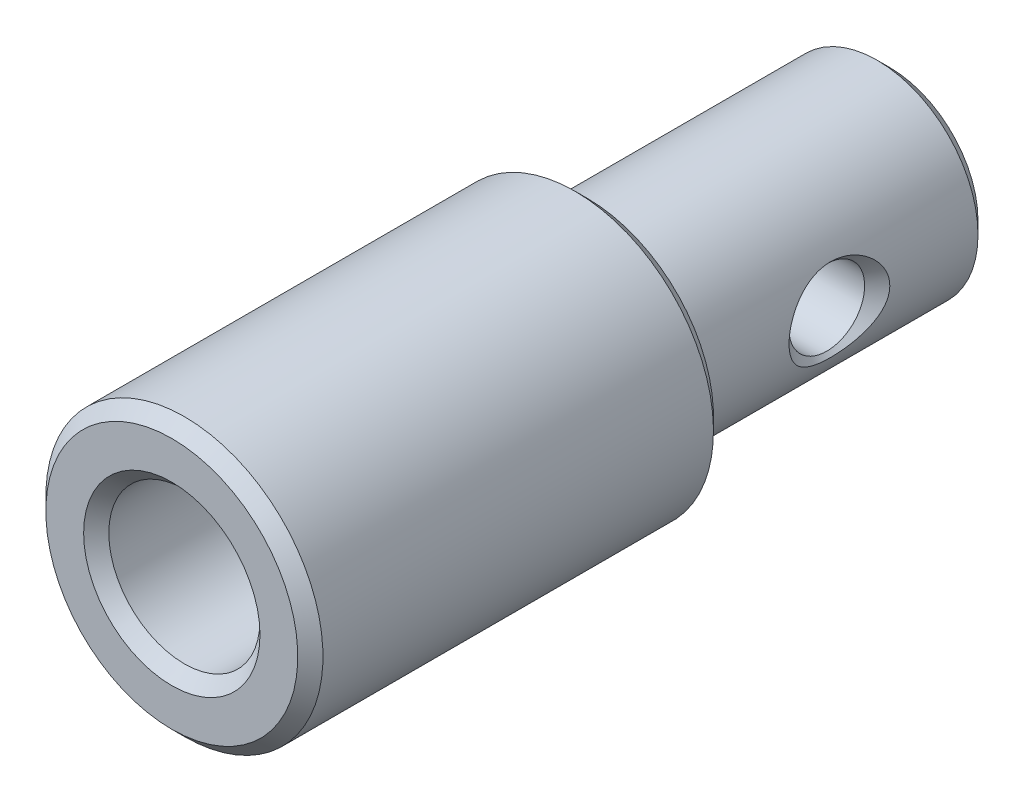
ISO-10303-21;
HEADER;
FILE_DESCRIPTION(('STEP AP214'),'2;1');
FILE_NAME('part.step','',(''),(''),'','','');
FILE_SCHEMA(('AUTOMOTIVE_DESIGN { 1 0 10303 214 1 1 1 1 }'));
ENDSEC;
DATA;
#1=APPLICATION_CONTEXT('core data for automotive mechanical design processes');
#2=APPLICATION_PROTOCOL_DEFINITION('international standard','automotive_design',2000,#1);
#3=PRODUCT_CONTEXT('',#1,'mechanical');
#4=PRODUCT('Part','Part','',(#3));
#5=PRODUCT_RELATED_PRODUCT_CATEGORY('part','',(#4));
#6=PRODUCT_DEFINITION_FORMATION('','',#4);
#7=PRODUCT_DEFINITION_CONTEXT('part definition',#1,'design');
#8=PRODUCT_DEFINITION('design','',#6,#7);
#9=PRODUCT_DEFINITION_SHAPE('','',#8);
#10=(LENGTH_UNIT() NAMED_UNIT(*) SI_UNIT(.MILLI.,.METRE.));
#11=(NAMED_UNIT(*) PLANE_ANGLE_UNIT() SI_UNIT($,.RADIAN.));
#12=(NAMED_UNIT(*) SI_UNIT($,.STERADIAN.) SOLID_ANGLE_UNIT());
#13=UNCERTAINTY_MEASURE_WITH_UNIT(LENGTH_MEASURE(1.E-05),#10,'distance_accuracy_value','');
#14=(GEOMETRIC_REPRESENTATION_CONTEXT(3) GLOBAL_UNCERTAINTY_ASSIGNED_CONTEXT((#13)) GLOBAL_UNIT_ASSIGNED_CONTEXT((#10,
#11,#12)) REPRESENTATION_CONTEXT('',''));
#15=CARTESIAN_POINT('',(0.,0.,0.));
#16=DIRECTION('',(0.,0.,1.));
#17=DIRECTION('',(1.,0.,0.));
#18=AXIS2_PLACEMENT_3D('',#15,#16,#17);
#19=CARTESIAN_POINT('',(0.,0.,0.));
#20=DIRECTION('',(0.,0.,1.));
#21=DIRECTION('',(0.,1.,0.));
#22=AXIS2_PLACEMENT_3D('',#19,#20,#21);
#23=CYLINDRICAL_SURFACE('',#22,4.);
#24=CARTESIAN_POINT('',(0.,0.,-16.9));
#25=DIRECTION('',(0.,0.,1.));
#26=DIRECTION('',(0.,1.,0.));
#27=AXIS2_PLACEMENT_3D('',#24,#25,#26);
#28=CIRCLE('',#27,4.);
#29=CARTESIAN_POINT('',(0.,4.,-16.9));
#30=VERTEX_POINT('',#29);
#31=EDGE_CURVE('E8',#30,#30,#28,.F.);
#32=ORIENTED_EDGE('',*,*,#31,.T.);
#33=EDGE_LOOP('',(#32));
#34=FACE_BOUND('',#33,.T.);
#35=CARTESIAN_POINT('',(-3.80472937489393,-1.23451791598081,-21.1835602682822));
#36=CARTESIAN_POINT('',(-3.82141231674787,-1.18309693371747,-21.1124648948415));
#37=CARTESIAN_POINT('',(-3.83847771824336,-1.12697352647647,-21.044888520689));
#38=CARTESIAN_POINT('',(-3.87208360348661,-1.00545328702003,-20.9184980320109));
#39=CARTESIAN_POINT('',(-3.88862452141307,-0.940064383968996,-20.8596765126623));
#40=CARTESIAN_POINT('',(-3.9186400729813,-0.805400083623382,-20.7567373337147));
#41=CARTESIAN_POINT('',(-3.93224905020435,-0.736730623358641,-20.7118720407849));
#42=CARTESIAN_POINT('',(-3.9565321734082,-0.592604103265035,-20.6336117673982));
#43=CARTESIAN_POINT('',(-3.96720735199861,-0.517149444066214,-20.6002127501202));
#44=CARTESIAN_POINT('',(-3.9845065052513,-0.36048765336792,-20.5467630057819));
#45=CARTESIAN_POINT('',(-3.99109919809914,-0.279241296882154,-20.5268152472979));
#46=CARTESIAN_POINT('',(-3.99921909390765,-0.114222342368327,-20.5023124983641));
#47=CARTESIAN_POINT('',(-4.00075049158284,-0.0304518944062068,-20.4977447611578));
#48=CARTESIAN_POINT('',(-3.99868687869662,0.125873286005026,-20.5039430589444));
#49=CARTESIAN_POINT('',(-3.99571044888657,0.198517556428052,-20.512858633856));
#50=CARTESIAN_POINT('',(-3.98606302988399,0.341197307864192,-20.5421156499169));
#51=CARTESIAN_POINT('',(-3.97939153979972,0.411232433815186,-20.5624586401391));
#52=CARTESIAN_POINT('',(-3.96294986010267,0.547523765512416,-20.6135588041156));
#53=CARTESIAN_POINT('',(-3.95315821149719,0.613749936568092,-20.6443882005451));
#54=CARTESIAN_POINT('',(-3.93132701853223,0.74083216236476,-20.7149617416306));
#55=CARTESIAN_POINT('',(-3.91928665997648,0.801686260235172,-20.7547091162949));
#56=CARTESIAN_POINT('',(-3.89181143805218,0.926559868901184,-20.8485630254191));
#57=CARTESIAN_POINT('',(-3.87614069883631,0.989565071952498,-20.9039455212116));
#58=CARTESIAN_POINT('',(-3.84420174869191,1.10717346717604,-21.0228419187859));
#59=CARTESIAN_POINT('',(-3.8279331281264,1.16177076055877,-21.0863614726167));
#60=CARTESIAN_POINT('',(-3.79253331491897,1.27310482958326,-21.2341870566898));
#61=CARTESIAN_POINT('',(-3.77352863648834,1.3278298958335,-21.3200416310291));
#62=CARTESIAN_POINT('',(-3.73809254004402,1.42454132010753,-21.4991475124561));
#63=CARTESIAN_POINT('',(-3.72166287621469,1.46651901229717,-21.5924037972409));
#64=CARTESIAN_POINT('',(-3.69066832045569,1.54303013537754,-21.7992249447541));
#65=CARTESIAN_POINT('',(-3.67678583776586,1.57540517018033,-21.9136988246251));
#66=CARTESIAN_POINT('',(-3.65625234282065,1.6224927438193,-22.1468372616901));
#67=CARTESIAN_POINT('',(-3.64960133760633,1.63720526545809,-22.2655018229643));
#68=CARTESIAN_POINT('',(-3.64433037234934,1.64891110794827,-22.5076964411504));
#69=CARTESIAN_POINT('',(-3.6459732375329,1.64532450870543,-22.6312609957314));
#70=CARTESIAN_POINT('',(-3.65767185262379,1.61914610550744,-22.8759889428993));
#71=CARTESIAN_POINT('',(-3.66773070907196,1.59654728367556,-22.9971514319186));
#72=CARTESIAN_POINT('',(-3.69482241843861,1.5327995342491,-23.2332761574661));
#73=CARTESIAN_POINT('',(-3.71183466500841,1.49170538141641,-23.3482555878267));
#74=CARTESIAN_POINT('',(-3.75060699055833,1.39134240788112,-23.5691743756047));
#75=CARTESIAN_POINT('',(-3.77236629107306,1.33207656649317,-23.6751152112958));
#76=CARTESIAN_POINT('',(-3.81405910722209,1.20687829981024,-23.8579717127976));
#77=CARTESIAN_POINT('',(-3.83370627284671,1.14363586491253,-23.9367975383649));
#78=CARTESIAN_POINT('',(-3.87238608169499,1.00488471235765,-24.0829673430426));
#79=CARTESIAN_POINT('',(-3.89141956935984,0.929393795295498,-24.1503276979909));
#80=CARTESIAN_POINT('',(-3.9231895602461,0.782960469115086,-24.2584069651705));
#81=CARTESIAN_POINT('',(-3.93642671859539,0.714076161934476,-24.301760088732));
#82=CARTESIAN_POINT('',(-3.95988417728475,0.569775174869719,-24.3769576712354));
#83=CARTESIAN_POINT('',(-3.97010639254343,0.4943626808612,-24.4088094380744));
#84=CARTESIAN_POINT('',(-3.98646371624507,0.338098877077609,-24.4591945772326));
#85=CARTESIAN_POINT('',(-3.99256815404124,0.25721158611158,-24.4776280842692));
#86=CARTESIAN_POINT('',(-3.99975341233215,0.0932110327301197,-24.4992847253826));
#87=CARTESIAN_POINT('',(-4.00083768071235,0.0100993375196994,-24.5025182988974));
#88=CARTESIAN_POINT('',(-3.99802883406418,-0.145114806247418,-24.494080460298));
#89=CARTESIAN_POINT('',(-3.99472275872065,-0.217331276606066,-24.4841671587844));
#90=CARTESIAN_POINT('',(-3.98448925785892,-0.359015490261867,-24.4530847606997));
#91=CARTESIAN_POINT('',(-3.97756132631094,-0.428482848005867,-24.4319140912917));
#92=CARTESIAN_POINT('',(-3.96062415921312,-0.564095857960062,-24.3791348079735));
#93=CARTESIAN_POINT('',(-3.95057035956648,-0.63017623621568,-24.3473747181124));
#94=CARTESIAN_POINT('',(-3.92827112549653,-0.756855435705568,-24.2749939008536));
#95=CARTESIAN_POINT('',(-3.91602485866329,-0.817452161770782,-24.23436980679));
#96=CARTESIAN_POINT('',(-3.88811955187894,-0.941929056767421,-24.1384963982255));
#97=CARTESIAN_POINT('',(-3.87222905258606,-1.00475028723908,-24.0819438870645));
#98=CARTESIAN_POINT('',(-3.83994441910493,-1.12183861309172,-23.9607278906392));
#99=CARTESIAN_POINT('',(-3.82354993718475,-1.17609963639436,-23.8960587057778));
#100=CARTESIAN_POINT('',(-3.78799301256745,-1.28652907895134,-23.7457227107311));
#101=CARTESIAN_POINT('',(-3.76898272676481,-1.34065241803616,-23.65851417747));
#102=CARTESIAN_POINT('',(-3.7337166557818,-1.43594657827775,-23.4767612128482));
#103=CARTESIAN_POINT('',(-3.71746272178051,-1.47710871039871,-23.3822119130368));
#104=CARTESIAN_POINT('',(-3.68711991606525,-1.55145399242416,-23.1731722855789));
#105=CARTESIAN_POINT('',(-3.67372167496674,-1.58251369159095,-23.057818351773));
#106=CARTESIAN_POINT('',(-3.65432280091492,-1.6268108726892,-22.8231560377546));
#107=CARTESIAN_POINT('',(-3.64832162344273,-1.64004966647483,-22.7038479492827));
#108=CARTESIAN_POINT('',(-3.64446625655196,-1.64860437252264,-22.461128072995));
#109=CARTESIAN_POINT('',(-3.64684243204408,-1.6434134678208,-22.3376941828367));
#110=CARTESIAN_POINT('',(-3.65992497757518,-1.61406255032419,-22.0934818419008));
#111=CARTESIAN_POINT('',(-3.67063702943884,-1.58988959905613,-21.9727052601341));
#112=CARTESIAN_POINT('',(-3.69928162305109,-1.52207114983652,-21.7342120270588));
#113=CARTESIAN_POINT('',(-3.71739445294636,-1.47793626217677,-21.6166562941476));
#114=CARTESIAN_POINT('',(-3.75832969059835,-1.37049287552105,-21.3915832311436));
#115=CARTESIAN_POINT('',(-3.78114743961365,-1.30720331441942,-21.2840561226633));
#116=CARTESIAN_POINT('',(-3.80472937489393,-1.23451791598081,-21.1835602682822));
#117=B_SPLINE_CURVE_WITH_KNOTS('',3,(#35,#36,#37,#38,#39,#40,#41,#42,#43,#44,#45,#46,#47,#48,
#49,#50,#51,#52,#53,#54,#55,#56,#57,#58,#59,#60,#61,#62,#63,#64,#65,#66,#67,#68,#69,#70,#71,#72,
#73,#74,#75,#76,#77,#78,#79,#80,#81,#82,#83,#84,#85,#86,#87,#88,#89,#90,#91,#92,#93,#94,#95,#96,
#97,#98,#99,#100,#101,#102,#103,#104,#105,#106,#107,#108,#109,#110,#111,#112,#113,#114,#115,
#116),.UNSPECIFIED.,.T.,.F.,(4,2,2,2,2,2,2,2,2,2,2,2,2,2,2,2,2,2,2,2,2,2,2,2,2,2,2,2,2,2,2,2,2,
2,2,2,2,2,2,2,4),(0.,0.267679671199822,0.535131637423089,0.78358699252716,1.03195478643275,
1.28220286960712,1.53224349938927,1.75093901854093,1.96966419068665,2.18992735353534,
2.41027042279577,2.66536290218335,2.92063354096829,3.23016058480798,3.53989758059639,
3.89758355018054,4.25526986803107,4.62436074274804,4.99358791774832,5.36172873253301,
5.72980922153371,6.03748706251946,6.34472169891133,6.59113405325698,6.83738956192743,
7.0854595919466,7.33335922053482,7.55122876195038,7.76912875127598,7.99028990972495,
8.21153521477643,8.46862977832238,8.72590589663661,9.03785534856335,9.35001348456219,
9.70900233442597,10.0679647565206,10.436874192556,10.8060353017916,11.1847833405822,
11.5631581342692),.UNSPECIFIED.);
#118=CARTESIAN_POINT('',(-3.80472937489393,-1.23451791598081,-21.1835602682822));
#119=VERTEX_POINT('',#118);
#120=EDGE_CURVE('E53',#119,#119,#117,.T.);
#121=ORIENTED_EDGE('',*,*,#120,.F.);
#122=EDGE_LOOP('',(#121));
#123=FACE_BOUND('',#122,.T.);
#124=CARTESIAN_POINT('',(0.,0.,-28.));
#125=DIRECTION('',(0.,0.,1.));
#126=DIRECTION('',(0.,1.,0.));
#127=AXIS2_PLACEMENT_3D('',#124,#125,#126);
#128=CIRCLE('',#127,4.);
#129=CARTESIAN_POINT('',(0.,4.,-28.));
#130=VERTEX_POINT('',#129);
#131=EDGE_CURVE('E32',#130,#130,#128,.T.);
#132=ORIENTED_EDGE('',*,*,#131,.T.);
#133=EDGE_LOOP('',(#132));
#134=FACE_BOUND('',#133,.T.);
#135=CARTESIAN_POINT('',(3.80472937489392,-1.23451791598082,-21.1835602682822));
#136=CARTESIAN_POINT('',(3.78241175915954,-1.30330627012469,-21.2786677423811));
#137=CARTESIAN_POINT('',(3.76077247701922,-1.36369021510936,-21.3800959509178));
#138=CARTESIAN_POINT('',(3.72155319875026,-1.46735243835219,-21.5921492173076));
#139=CARTESIAN_POINT('',(3.70397924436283,-1.5106053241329,-21.702787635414));
#140=CARTESIAN_POINT('',(3.67498709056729,-1.57984059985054,-21.9309920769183));
#141=CARTESIAN_POINT('',(3.66361294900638,-1.60569967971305,-22.0486012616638));
#142=CARTESIAN_POINT('',(3.64871737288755,-1.63926954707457,-22.2867884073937));
#143=CARTESIAN_POINT('',(3.64519065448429,-1.64699254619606,-22.407364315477));
#144=CARTESIAN_POINT('',(3.64647116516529,-1.64415740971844,-22.6507343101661));
#145=CARTESIAN_POINT('',(3.65145045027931,-1.63322186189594,-22.773523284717));
#146=CARTESIAN_POINT('',(3.66937803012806,-1.59252926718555,-23.0154199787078));
#147=CARTESIAN_POINT('',(3.68233183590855,-1.56275920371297,-23.1345250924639));
#148=CARTESIAN_POINT('',(3.71447101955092,-1.48474920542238,-23.3657956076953));
#149=CARTESIAN_POINT('',(3.73366407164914,-1.43648651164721,-23.4779522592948));
#150=CARTESIAN_POINT('',(3.77578170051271,-1.32181445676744,-23.6918369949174));
#151=CARTESIAN_POINT('',(3.79870412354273,-1.2554155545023,-23.7935710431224));
#152=CARTESIAN_POINT('',(3.84036373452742,-1.12048758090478,-23.9629675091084));
#153=CARTESIAN_POINT('',(3.85897820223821,-1.05528278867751,-24.0333130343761));
#154=CARTESIAN_POINT('',(3.89485380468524,-0.914003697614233,-24.162491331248));
#155=CARTESIAN_POINT('',(3.91211692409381,-0.837945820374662,-24.221341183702));
#156=CARTESIAN_POINT('',(3.94046761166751,-0.690827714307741,-24.3149793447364));
#157=CARTESIAN_POINT('',(3.95210697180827,-0.621429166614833,-24.3522032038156));
#158=CARTESIAN_POINT('',(3.97210911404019,-0.477115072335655,-24.4151131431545));
#159=CARTESIAN_POINT('',(3.98047400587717,-0.402203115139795,-24.4408066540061));
#160=CARTESIAN_POINT('',(3.99304005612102,-0.248237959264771,-24.4791092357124));
#161=CARTESIAN_POINT('',(3.99721606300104,-0.169162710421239,-24.491639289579));
#162=CARTESIAN_POINT('',(4.00077878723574,-0.00994168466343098,-24.5023417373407));
#163=CARTESIAN_POINT('',(4.00016728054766,0.070203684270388,-24.5005194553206));
#164=CARTESIAN_POINT('',(3.99454071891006,0.220831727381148,-24.483580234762));
#165=CARTESIAN_POINT('',(3.98996665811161,0.291486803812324,-24.4697944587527));
#166=CARTESIAN_POINT('',(3.97747579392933,0.429526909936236,-24.4315820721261));
#167=CARTESIAN_POINT('',(3.96955834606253,0.496911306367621,-24.4071534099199));
#168=CARTESIAN_POINT('',(3.95066634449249,0.630053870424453,-24.3475931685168));
#169=CARTESIAN_POINT('',(3.93956835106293,0.695596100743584,-24.3120225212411));
#170=CARTESIAN_POINT('',(3.91541233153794,0.820741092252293,-24.2322118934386));
#171=CARTESIAN_POINT('',(3.90235343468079,0.880341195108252,-24.1879680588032));
#172=CARTESIAN_POINT('',(3.87276884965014,1.00316102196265,-24.0837492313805));
#173=CARTESIAN_POINT('',(3.85603944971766,1.06514235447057,-24.0223759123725));
#174=CARTESIAN_POINT('',(3.8224839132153,1.17991420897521,-23.8915999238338));
#175=CARTESIAN_POINT('',(3.80565771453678,1.23269793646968,-23.8221913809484));
#176=CARTESIAN_POINT('',(3.76970394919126,1.33907428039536,-23.6616603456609));
#177=CARTESIAN_POINT('',(3.7508364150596,1.39050324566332,-23.5690408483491));
#178=CARTESIAN_POINT('',(3.71661969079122,1.47953147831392,-23.3767629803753));
#179=CARTESIAN_POINT('',(3.70127253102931,1.51712277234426,-23.2771005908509));
#180=CARTESIAN_POINT('',(3.6739839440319,1.58216986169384,-23.059657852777));
#181=CARTESIAN_POINT('',(3.6627403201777,1.6076843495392,-22.9412019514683));
#182=CARTESIAN_POINT('',(3.64823136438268,1.64034474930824,-22.7013246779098));
#183=CARTESIAN_POINT('',(3.64496538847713,1.6474921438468,-22.5799035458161));
#184=CARTESIAN_POINT('',(3.64687300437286,1.64326657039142,-22.335777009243));
#185=CARTESIAN_POINT('',(3.6521628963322,1.63163838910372,-22.2130768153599));
#186=CARTESIAN_POINT('',(3.67066155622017,1.58957908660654,-21.9714967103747));
#187=CARTESIAN_POINT('',(3.6838747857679,1.55913737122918,-21.8526189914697));
#188=CARTESIAN_POINT('',(3.71645846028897,1.47978806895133,-21.621865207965));
#189=CARTESIAN_POINT('',(3.73583927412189,1.43084935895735,-21.5100013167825));
#190=CARTESIAN_POINT('',(3.77823214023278,1.31482556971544,-21.2968349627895));
#191=CARTESIAN_POINT('',(3.80124203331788,1.24775126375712,-21.1955262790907));
#192=CARTESIAN_POINT('',(3.84285133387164,1.1119363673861,-21.0274390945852));
#193=CARTESIAN_POINT('',(3.86134908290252,1.04657782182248,-20.9578974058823));
#194=CARTESIAN_POINT('',(3.89692794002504,0.905123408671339,-20.8303260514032));
#195=CARTESIAN_POINT('',(3.91401113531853,0.829043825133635,-20.7722792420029));
#196=CARTESIAN_POINT('',(3.94202362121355,0.681898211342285,-20.6799955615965));
#197=CARTESIAN_POINT('',(3.95350700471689,0.612455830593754,-20.6433461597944));
#198=CARTESIAN_POINT('',(3.97317520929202,0.468150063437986,-20.581587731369));
#199=CARTESIAN_POINT('',(3.98136214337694,0.393290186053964,-20.5564713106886));
#200=CARTESIAN_POINT('',(3.99356812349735,0.239550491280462,-20.5192983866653));
#201=CARTESIAN_POINT('',(3.99756256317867,0.16064976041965,-20.5073189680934));
#202=CARTESIAN_POINT('',(4.0007861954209,0.0018837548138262,-20.497637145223));
#203=CARTESIAN_POINT('',(4.00001709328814,-0.0779811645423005,-20.4999296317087));
#204=CARTESIAN_POINT('',(3.99412561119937,-0.228183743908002,-20.5176721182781));
#205=CARTESIAN_POINT('',(3.98943067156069,-0.298696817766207,-20.5318305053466));
#206=CARTESIAN_POINT('',(3.9767238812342,-0.436409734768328,-20.5707344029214));
#207=CARTESIAN_POINT('',(3.96871112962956,-0.503608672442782,-20.5954827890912));
#208=CARTESIAN_POINT('',(3.94962646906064,-0.636540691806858,-20.6557252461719));
#209=CARTESIAN_POINT('',(3.93842419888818,-0.702041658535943,-20.6916853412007));
#210=CARTESIAN_POINT('',(3.91408535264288,-0.827040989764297,-20.7722524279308));
#211=CARTESIAN_POINT('',(3.90094851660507,-0.886538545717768,-20.8168605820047));
#212=CARTESIAN_POINT('',(3.87399762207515,-0.997662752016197,-20.9120528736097));
#213=CARTESIAN_POINT('',(3.86020892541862,-1.04944979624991,-20.9624583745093));
#214=CARTESIAN_POINT('',(3.83243780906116,-1.14672556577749,-21.0689639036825));
#215=CARTESIAN_POINT('',(3.81845529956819,-1.192211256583,-21.1250666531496));
#216=CARTESIAN_POINT('',(3.80472937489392,-1.23451791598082,-21.1835602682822));
#217=B_SPLINE_CURVE_WITH_KNOTS('',3,(#135,#136,#137,#138,#139,#140,#141,#142,#143,#144,#145,
#146,#147,#148,#149,#150,#151,#152,#153,#154,#155,#156,#157,#158,#159,#160,#161,#162,#163,#164,
#165,#166,#167,#168,#169,#170,#171,#172,#173,#174,#175,#176,#177,#178,#179,#180,#181,#182,#183,
#184,#185,#186,#187,#188,#189,#190,#191,#192,#193,#194,#195,#196,#197,#198,#199,#200,#201,#202,
#203,#204,#205,#206,#207,#208,#209,#210,#211,#212,#213,#214,#215,#216),.UNSPECIFIED.,.T.,.F.,(4,
2,2,2,2,2,2,2,2,2,2,2,2,2,2,2,2,2,2,2,2,2,2,2,2,2,2,2,2,2,2,2,2,2,2,2,2,2,2,2,4),(0.,
0.358167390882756,0.716863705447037,1.07807685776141,1.43904672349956,1.8074048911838,
2.17601791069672,2.5450860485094,2.91394179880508,3.20596996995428,3.49756087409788,
3.73542007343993,3.97312576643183,4.21225033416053,4.45128620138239,4.66670773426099,
4.88217081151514,5.10750507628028,5.33293970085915,5.59842877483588,5.86411314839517,
6.18566278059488,6.5073974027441,6.87076985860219,7.23411298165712,7.60243667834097,
7.9709679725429,8.34012213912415,8.70905749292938,8.99960465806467,9.28971517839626,
9.52682068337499,9.76377396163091,10.002110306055,10.2403613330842,10.4556112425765,
10.6709196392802,10.8967498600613,11.1226104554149,11.3427872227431,11.5630696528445),.UNSPECIFIED.);
#218=CARTESIAN_POINT('',(3.80472937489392,-1.23451791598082,-21.1835602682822));
#219=VERTEX_POINT('',#218);
#220=EDGE_CURVE('E108',#219,#219,#217,.T.);
#221=ORIENTED_EDGE('',*,*,#220,.F.);
#222=EDGE_LOOP('',(#221));
#223=FACE_BOUND('',#222,.T.);
#224=ADVANCED_FACE('F12',(#34,#123,#134,#223),#23,.T.);
#225=CARTESIAN_POINT('',(5.5,0.,-22.5));
#226=DIRECTION('',(-1.,0.,0.));
#227=DIRECTION('',(0.,1.,0.));
#228=AXIS2_PLACEMENT_3D('',#225,#226,#227);
#229=CYLINDRICAL_SURFACE('',#228,1.5);
#230=CARTESIAN_POINT('',(-3.5,0.,-22.5));
#231=DIRECTION('',(-1.,0.,0.));
#232=DIRECTION('',(0.,0.,1.));
#233=AXIS2_PLACEMENT_3D('',#230,#231,#232);
#234=CIRCLE('',#233,1.5);
#235=CARTESIAN_POINT('',(-3.5,0.,-21.));
#236=VERTEX_POINT('',#235);
#237=EDGE_CURVE('E61',#236,#236,#234,.T.);
#238=ORIENTED_EDGE('',*,*,#237,.T.);
#239=EDGE_LOOP('',(#238));
#240=FACE_BOUND('',#239,.T.);
#241=CARTESIAN_POINT('',(3.5,0.,-22.5));
#242=DIRECTION('',(-1.,0.,0.));
#243=DIRECTION('',(0.,0.,1.));
#244=AXIS2_PLACEMENT_3D('',#241,#242,#243);
#245=CIRCLE('',#244,1.5);
#246=CARTESIAN_POINT('',(3.5,0.,-21.));
#247=VERTEX_POINT('',#246);
#248=EDGE_CURVE('E110',#247,#247,#245,.T.);
#249=ORIENTED_EDGE('',*,*,#248,.F.);
#250=EDGE_LOOP('',(#249));
#251=FACE_BOUND('',#250,.T.);
#252=ADVANCED_FACE('F76',(#240,#251),#229,.F.);
#253=CARTESIAN_POINT('',(0.,0.,0.));
#254=DIRECTION('',(0.,0.,1.));
#255=DIRECTION('',(0.,1.,0.));
#256=AXIS2_PLACEMENT_3D('',#253,#254,#255);
#257=CYLINDRICAL_SURFACE('',#256,5.5);
#258=CARTESIAN_POINT('',(0.,0.,-0.5));
#259=DIRECTION('',(0.,0.,-1.));
#260=DIRECTION('',(0.,-1.,0.));
#261=AXIS2_PLACEMENT_3D('',#258,#259,#260);
#262=CIRCLE('',#261,5.5);
#263=CARTESIAN_POINT('',(0.,-5.5,-0.5));
#264=VERTEX_POINT('',#263);
#265=EDGE_CURVE('E47',#264,#264,#262,.T.);
#266=ORIENTED_EDGE('',*,*,#265,.T.);
#267=EDGE_LOOP('',(#266));
#268=FACE_BOUND('',#267,.T.);
#269=CARTESIAN_POINT('',(0.,0.,-16.));
#270=DIRECTION('',(0.,0.,1.));
#271=DIRECTION('',(0.,1.,0.));
#272=AXIS2_PLACEMENT_3D('',#269,#270,#271);
#273=CIRCLE('',#272,5.5);
#274=CARTESIAN_POINT('',(0.,5.5,-16.));
#275=VERTEX_POINT('',#274);
#276=EDGE_CURVE('E44',#275,#275,#273,.T.);
#277=ORIENTED_EDGE('',*,*,#276,.T.);
#278=EDGE_LOOP('',(#277));
#279=FACE_BOUND('',#278,.T.);
#280=ADVANCED_FACE('F79',(#268,#279),#257,.T.);
#281=CARTESIAN_POINT('',(0.,0.,0.));
#282=DIRECTION('',(0.,0.,1.));
#283=DIRECTION('',(0.,1.,0.));
#284=AXIS2_PLACEMENT_3D('',#281,#282,#283);
#285=CYLINDRICAL_SURFACE('',#284,3.);
#286=CARTESIAN_POINT('',(0.,0.,-0.5));
#287=DIRECTION('',(0.,0.,-1.));
#288=DIRECTION('',(0.,-1.,0.));
#289=AXIS2_PLACEMENT_3D('',#286,#287,#288);
#290=CIRCLE('',#289,3.);
#291=CARTESIAN_POINT('',(0.,-3.,-0.5));
#292=VERTEX_POINT('',#291);
#293=EDGE_CURVE('E38',#292,#292,#290,.F.);
#294=ORIENTED_EDGE('',*,*,#293,.T.);
#295=EDGE_LOOP('',(#294));
#296=FACE_BOUND('',#295,.T.);
#297=CARTESIAN_POINT('',(0.,0.,-8.));
#298=DIRECTION('',(0.,0.,1.));
#299=DIRECTION('',(0.,1.,0.));
#300=AXIS2_PLACEMENT_3D('',#297,#298,#299);
#301=CIRCLE('',#300,3.);
#302=CARTESIAN_POINT('',(0.,3.,-8.));
#303=VERTEX_POINT('',#302);
#304=EDGE_CURVE('E50',#303,#303,#301,.T.);
#305=ORIENTED_EDGE('',*,*,#304,.F.);
#306=EDGE_LOOP('',(#305));
#307=FACE_BOUND('',#306,.T.);
#308=ADVANCED_FACE('F81',(#296,#307),#285,.F.);
#309=CARTESIAN_POINT('',(0.,0.,0.));
#310=DIRECTION('',(0.,0.,-1.));
#311=DIRECTION('',(0.,-1.,0.));
#312=AXIS2_PLACEMENT_3D('',#309,#310,#311);
#313=PLANE('',#312);
#314=CARTESIAN_POINT('',(0.,0.,0.));
#315=DIRECTION('',(0.,0.,-1.));
#316=DIRECTION('',(0.,-1.,0.));
#317=AXIS2_PLACEMENT_3D('',#314,#315,#316);
#318=CIRCLE('',#317,3.5);
#319=CARTESIAN_POINT('',(0.,-3.5,0.));
#320=VERTEX_POINT('',#319);
#321=EDGE_CURVE('E23',#320,#320,#318,.T.);
#322=ORIENTED_EDGE('',*,*,#321,.T.);
#323=EDGE_LOOP('',(#322));
#324=FACE_BOUND('',#323,.T.);
#325=CARTESIAN_POINT('',(0.,0.,0.));
#326=DIRECTION('',(0.,0.,-1.));
#327=DIRECTION('',(0.,-1.,0.));
#328=AXIS2_PLACEMENT_3D('',#325,#326,#327);
#329=CIRCLE('',#328,5.);
#330=CARTESIAN_POINT('',(0.,-5.,0.));
#331=VERTEX_POINT('',#330);
#332=EDGE_CURVE('E34',#331,#331,#329,.F.);
#333=ORIENTED_EDGE('',*,*,#332,.T.);
#334=EDGE_LOOP('',(#333));
#335=FACE_BOUND('',#334,.T.);
#336=ADVANCED_FACE('F83',(#324,#335),#313,.F.);
#337=CARTESIAN_POINT('',(0.,0.,-0.5));
#338=DIRECTION('',(0.,0.,1.));
#339=DIRECTION('',(0.,1.,0.));
#340=AXIS2_PLACEMENT_3D('',#337,#338,#339);
#341=CONICAL_SURFACE('',#340,3.,0.785398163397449);
#342=ORIENTED_EDGE('',*,*,#293,.F.);
#343=EDGE_LOOP('',(#342));
#344=FACE_BOUND('',#343,.T.);
#345=ORIENTED_EDGE('',*,*,#321,.F.);
#346=EDGE_LOOP('',(#345));
#347=FACE_BOUND('',#346,.T.);
#348=ADVANCED_FACE('F187',(#344,#347),#341,.F.);
#349=CARTESIAN_POINT('',(0.,0.,0.));
#350=DIRECTION('',(0.,0.,-1.));
#351=DIRECTION('',(0.,-1.,0.));
#352=AXIS2_PLACEMENT_3D('',#349,#350,#351);
#353=CONICAL_SURFACE('',#352,5.,0.785398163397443);
#354=ORIENTED_EDGE('',*,*,#332,.F.);
#355=EDGE_LOOP('',(#354));
#356=FACE_BOUND('',#355,.T.);
#357=ORIENTED_EDGE('',*,*,#265,.F.);
#358=EDGE_LOOP('',(#357));
#359=FACE_BOUND('',#358,.T.);
#360=ADVANCED_FACE('F97',(#356,#359),#353,.T.);
#361=CARTESIAN_POINT('',(-5.5,0.,-16.5));
#362=DIRECTION('',(0.,0.,1.));
#363=DIRECTION('',(0.,1.,0.));
#364=AXIS2_PLACEMENT_3D('',#361,#362,#363);
#365=PLANE('',#364);
#366=CARTESIAN_POINT('',(0.,0.,-16.5));
#367=DIRECTION('',(0.,0.,1.));
#368=DIRECTION('',(0.,1.,0.));
#369=AXIS2_PLACEMENT_3D('',#366,#367,#368);
#370=CIRCLE('',#369,4.4);
#371=CARTESIAN_POINT('',(0.,4.4,-16.5));
#372=VERTEX_POINT('',#371);
#373=EDGE_CURVE('E19',#372,#372,#370,.T.);
#374=ORIENTED_EDGE('',*,*,#373,.T.);
#375=EDGE_LOOP('',(#374));
#376=FACE_BOUND('',#375,.T.);
#377=CARTESIAN_POINT('',(0.,0.,-16.5));
#378=DIRECTION('',(0.,0.,1.));
#379=DIRECTION('',(0.,1.,0.));
#380=AXIS2_PLACEMENT_3D('',#377,#378,#379);
#381=CIRCLE('',#380,5.);
#382=CARTESIAN_POINT('',(0.,5.,-16.5));
#383=VERTEX_POINT('',#382);
#384=EDGE_CURVE('E41',#383,#383,#381,.F.);
#385=ORIENTED_EDGE('',*,*,#384,.T.);
#386=EDGE_LOOP('',(#385));
#387=FACE_BOUND('',#386,.T.);
#388=ADVANCED_FACE('F88',(#376,#387),#365,.F.);
#389=CARTESIAN_POINT('',(-4.,0.,-28.5));
#390=DIRECTION('',(0.,0.,1.));
#391=DIRECTION('',(0.,1.,0.));
#392=AXIS2_PLACEMENT_3D('',#389,#390,#391);
#393=PLANE('',#392);
#394=CARTESIAN_POINT('',(0.,0.,-28.5));
#395=DIRECTION('',(0.,0.,1.));
#396=DIRECTION('',(0.,1.,0.));
#397=AXIS2_PLACEMENT_3D('',#394,#395,#396);
#398=CIRCLE('',#397,3.5);
#399=CARTESIAN_POINT('',(0.,3.5,-28.5));
#400=VERTEX_POINT('',#399);
#401=EDGE_CURVE('E27',#400,#400,#398,.F.);
#402=ORIENTED_EDGE('',*,*,#401,.T.);
#403=EDGE_LOOP('',(#402));
#404=FACE_BOUND('',#403,.T.);
#405=ADVANCED_FACE('F85',(#404),#393,.F.);
#406=CARTESIAN_POINT('',(0.,0.,-16.));
#407=DIRECTION('',(0.,0.,1.));
#408=DIRECTION('',(0.,1.,0.));
#409=AXIS2_PLACEMENT_3D('',#406,#407,#408);
#410=CONICAL_SURFACE('',#409,5.5,0.785398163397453);
#411=ORIENTED_EDGE('',*,*,#384,.F.);
#412=EDGE_LOOP('',(#411));
#413=FACE_BOUND('',#412,.T.);
#414=ORIENTED_EDGE('',*,*,#276,.F.);
#415=EDGE_LOOP('',(#414));
#416=FACE_BOUND('',#415,.T.);
#417=ADVANCED_FACE('F87',(#413,#416),#410,.T.);
#418=CARTESIAN_POINT('',(0.,0.,-28.));
#419=DIRECTION('',(0.,0.,1.));
#420=DIRECTION('',(0.,1.,0.));
#421=AXIS2_PLACEMENT_3D('',#418,#419,#420);
#422=CONICAL_SURFACE('',#421,4.,0.785398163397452);
#423=ORIENTED_EDGE('',*,*,#401,.F.);
#424=EDGE_LOOP('',(#423));
#425=FACE_BOUND('',#424,.T.);
#426=ORIENTED_EDGE('',*,*,#131,.F.);
#427=EDGE_LOOP('',(#426));
#428=FACE_BOUND('',#427,.T.);
#429=ADVANCED_FACE('F72',(#425,#428),#422,.T.);
#430=CARTESIAN_POINT('',(-3.5,0.,-22.5));
#431=DIRECTION('',(-1.,0.,0.));
#432=DIRECTION('',(0.,0.,1.));
#433=AXIS2_PLACEMENT_3D('',#430,#431,#432);
#434=CONICAL_SURFACE('',#433,1.5,0.785398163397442);
#435=ORIENTED_EDGE('',*,*,#237,.F.);
#436=EDGE_LOOP('',(#435));
#437=FACE_BOUND('',#436,.T.);
#438=ORIENTED_EDGE('',*,*,#120,.T.);
#439=EDGE_LOOP('',(#438));
#440=FACE_BOUND('',#439,.T.);
#441=ADVANCED_FACE('F66',(#437,#440),#434,.F.);
#442=CARTESIAN_POINT('',(4.,0.,-22.5));
#443=DIRECTION('',(1.,0.,0.));
#444=DIRECTION('',(0.,0.,-1.));
#445=AXIS2_PLACEMENT_3D('',#442,#443,#444);
#446=CONICAL_SURFACE('',#445,2.,0.785398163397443);
#447=ORIENTED_EDGE('',*,*,#248,.T.);
#448=EDGE_LOOP('',(#447));
#449=FACE_BOUND('',#448,.T.);
#450=ORIENTED_EDGE('',*,*,#220,.T.);
#451=EDGE_LOOP('',(#450));
#452=FACE_BOUND('',#451,.T.);
#453=ADVANCED_FACE('F71',(#449,#452),#446,.F.);
#454=CARTESIAN_POINT('',(0.,0.,-16.9));
#455=DIRECTION('',(0.,0.,1.));
#456=DIRECTION('',(0.,1.,0.));
#457=AXIS2_PLACEMENT_3D('',#454,#455,#456);
#458=TOROIDAL_SURFACE('',#457,4.4,0.4);
#459=ORIENTED_EDGE('',*,*,#31,.F.);
#460=EDGE_LOOP('',(#459));
#461=FACE_BOUND('',#460,.T.);
#462=ORIENTED_EDGE('',*,*,#373,.F.);
#463=EDGE_LOOP('',(#462));
#464=FACE_BOUND('',#463,.T.);
#465=ADVANCED_FACE('F14',(#461,#464),#458,.F.);
#466=CARTESIAN_POINT('',(0.,0.,-8.));
#467=DIRECTION('',(0.,0.,1.));
#468=DIRECTION('',(0.,1.,0.));
#469=AXIS2_PLACEMENT_3D('',#466,#467,#468);
#470=PLANE('',#469);
#471=ORIENTED_EDGE('',*,*,#304,.T.);
#472=EDGE_LOOP('',(#471));
#473=FACE_BOUND('',#472,.T.);
#474=ADVANCED_FACE('F124',(#473),#470,.T.);
#475=CLOSED_SHELL('',(#224,#252,#280,#308,#336,#348,#360,#388,#405,#417,#429,#441,#453,#465,#474));
#476=MANIFOLD_SOLID_BREP('B1',#475);
#477=ADVANCED_BREP_SHAPE_REPRESENTATION('',(#18,#476),#14);
#478=SHAPE_DEFINITION_REPRESENTATION(#9,#477);
ENDSEC;
END-ISO-10303-21;
